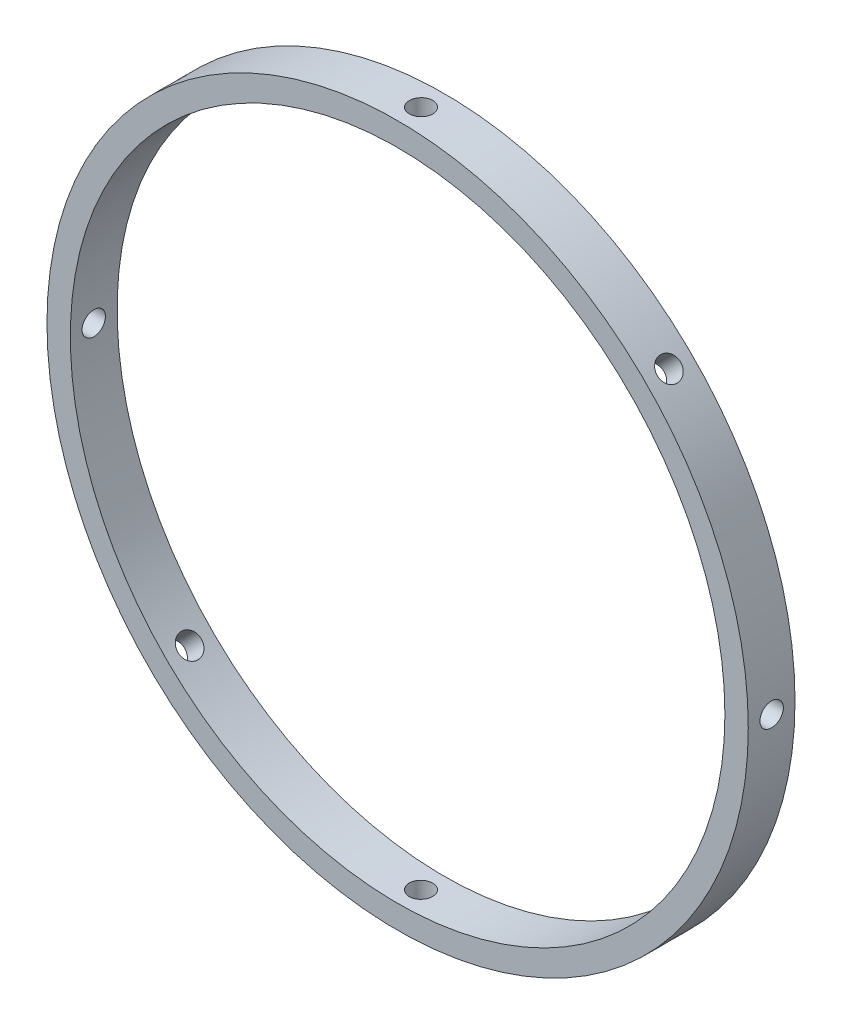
from build123d import *

# Parameters (mm, degrees)
CROQUIS2_R            = 300
CROQUIS2_R_2          = 280
EXTRUIR_L_MINA1_DEPTH = 40
CROQUIS3_R            = 10
CORTAR_EXTRUIR1_DEPTH = 427.145515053
MATRIZC1_COUNT        = 5
MATRIZC1_ANGLE        = 180


with BuildPart() as part:
    # Croquis2 → Extruir-L_mina1 (new body)
    with BuildSketch(Plane.XY):
        Circle(CROQUIS2_R)
        Circle(CROQUIS2_R_2, mode=Mode.SUBTRACT)
    extrude(amount=EXTRUIR_L_MINA1_DEPTH)

    # Croquis3 → Cortar-Extruir1 (cut, symmetric)
    with BuildSketch(Plane(origin=(0, 0, 0), x_dir=(0, 0, -1), z_dir=(1, 0, 0))):
        with Locations((-20, 0)):
            Circle(CROQUIS3_R)
    cortar_extruir1 = extrude(amount=CORTAR_EXTRUIR1_DEPTH, both=True, mode=Mode.SUBTRACT)

    # MatrizC1: Cortar-Extruir1 ×5 about axis
    matrizc1_axis = Axis((0, 0, 40), (0, 0, 1))
    for i in range(1, MATRIZC1_COUNT):
        add(cortar_extruir1.rotate(matrizc1_axis, i * MATRIZC1_ANGLE / (MATRIZC1_COUNT - 1)), mode=Mode.SUBTRACT)


solid = part.part
